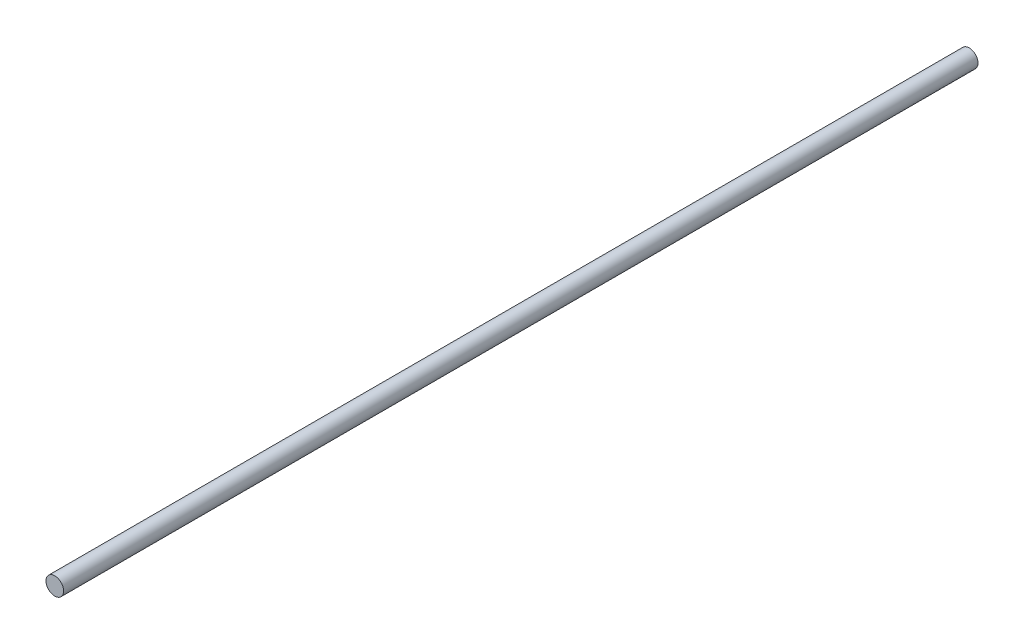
ISO-10303-21;
HEADER;
FILE_DESCRIPTION(('STEP AP214'),'2;1');
FILE_NAME('part.step','',(''),(''),'','','');
FILE_SCHEMA(('AUTOMOTIVE_DESIGN { 1 0 10303 214 1 1 1 1 }'));
ENDSEC;
DATA;
#1=APPLICATION_CONTEXT('core data for automotive mechanical design processes');
#2=APPLICATION_PROTOCOL_DEFINITION('international standard','automotive_design',2000,#1);
#3=PRODUCT_CONTEXT('',#1,'mechanical');
#4=PRODUCT('Part','Part','',(#3));
#5=PRODUCT_RELATED_PRODUCT_CATEGORY('part','',(#4));
#6=PRODUCT_DEFINITION_FORMATION('','',#4);
#7=PRODUCT_DEFINITION_CONTEXT('part definition',#1,'design');
#8=PRODUCT_DEFINITION('design','',#6,#7);
#9=PRODUCT_DEFINITION_SHAPE('','',#8);
#10=(LENGTH_UNIT() NAMED_UNIT(*) SI_UNIT(.MILLI.,.METRE.));
#11=(NAMED_UNIT(*) PLANE_ANGLE_UNIT() SI_UNIT($,.RADIAN.));
#12=(NAMED_UNIT(*) SI_UNIT($,.STERADIAN.) SOLID_ANGLE_UNIT());
#13=UNCERTAINTY_MEASURE_WITH_UNIT(LENGTH_MEASURE(1.E-05),#10,'distance_accuracy_value','');
#14=(GEOMETRIC_REPRESENTATION_CONTEXT(3) GLOBAL_UNCERTAINTY_ASSIGNED_CONTEXT((#13)) GLOBAL_UNIT_ASSIGNED_CONTEXT((#10,
#11,#12)) REPRESENTATION_CONTEXT('',''));
#15=CARTESIAN_POINT('',(0.,0.,0.));
#16=DIRECTION('',(0.,0.,1.));
#17=DIRECTION('',(1.,0.,0.));
#18=AXIS2_PLACEMENT_3D('',#15,#16,#17);
#19=CARTESIAN_POINT('',(0.,0.,-207.5));
#20=DIRECTION('',(0.,0.,1.));
#21=DIRECTION('',(1.,0.,0.));
#22=AXIS2_PLACEMENT_3D('',#19,#20,#21);
#23=CYLINDRICAL_SURFACE('',#22,4.);
#24=CARTESIAN_POINT('',(0.,0.,-207.5));
#25=DIRECTION('',(0.,0.,1.));
#26=DIRECTION('',(1.,0.,0.));
#27=AXIS2_PLACEMENT_3D('',#24,#25,#26);
#28=CIRCLE('',#27,4.);
#29=CARTESIAN_POINT('',(4.,0.,-207.5));
#30=VERTEX_POINT('',#29);
#31=EDGE_CURVE('E10',#30,#30,#28,.T.);
#32=ORIENTED_EDGE('',*,*,#31,.T.);
#33=EDGE_LOOP('',(#32));
#34=FACE_BOUND('',#33,.T.);
#35=CARTESIAN_POINT('',(0.,0.,207.5));
#36=DIRECTION('',(0.,0.,1.));
#37=DIRECTION('',(1.,0.,0.));
#38=AXIS2_PLACEMENT_3D('',#35,#36,#37);
#39=CIRCLE('',#38,4.);
#40=CARTESIAN_POINT('',(4.,0.,207.5));
#41=VERTEX_POINT('',#40);
#42=EDGE_CURVE('E42',#41,#41,#39,.T.);
#43=ORIENTED_EDGE('',*,*,#42,.F.);
#44=EDGE_LOOP('',(#43));
#45=FACE_BOUND('',#44,.T.);
#46=ADVANCED_FACE('F39',(#34,#45),#23,.T.);
#47=CARTESIAN_POINT('',(0.,0.,-207.5));
#48=DIRECTION('',(0.,0.,1.));
#49=DIRECTION('',(1.,0.,0.));
#50=AXIS2_PLACEMENT_3D('',#47,#48,#49);
#51=PLANE('',#50);
#52=ORIENTED_EDGE('',*,*,#31,.F.);
#53=EDGE_LOOP('',(#52));
#54=FACE_BOUND('',#53,.T.);
#55=ADVANCED_FACE('F54',(#54),#51,.F.);
#56=CARTESIAN_POINT('',(0.,0.,207.5));
#57=DIRECTION('',(0.,0.,1.));
#58=DIRECTION('',(1.,0.,0.));
#59=AXIS2_PLACEMENT_3D('',#56,#57,#58);
#60=PLANE('',#59);
#61=ORIENTED_EDGE('',*,*,#42,.T.);
#62=EDGE_LOOP('',(#61));
#63=FACE_BOUND('',#62,.T.);
#64=ADVANCED_FACE('F51',(#63),#60,.T.);
#65=CLOSED_SHELL('',(#46,#55,#64));
#66=MANIFOLD_SOLID_BREP('B2',#65);
#67=ADVANCED_BREP_SHAPE_REPRESENTATION('',(#18,#66),#14);
#68=SHAPE_DEFINITION_REPRESENTATION(#9,#67);
ENDSEC;
END-ISO-10303-21;
